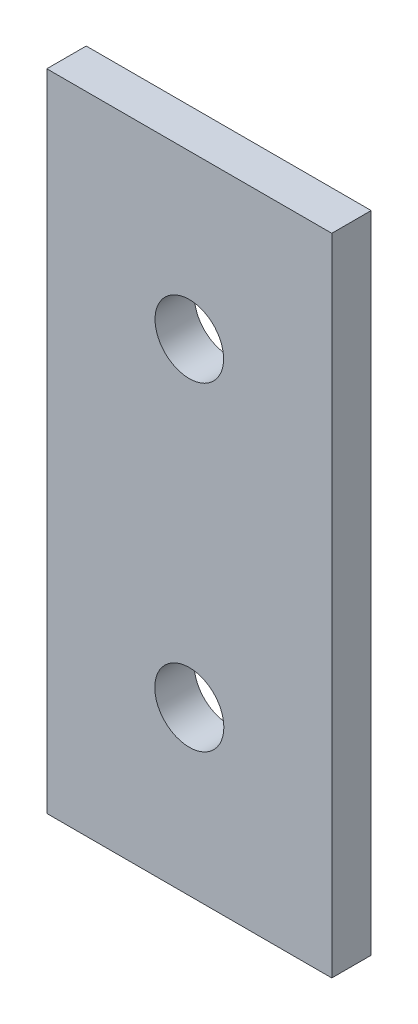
from build123d import *

# Parameters (mm, degrees)
SKETCH1_W           = 33.782
SKETCH1_H           = 76.454
BOSS_EXTRUDE1_DEPTH = 4.67106
SKETCH2_R           = 4.064
SKETCH2_R_2         = 4.094725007
CUT_EXTRUDE1_DEPTH  = 43.052683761


with BuildPart() as part:
    # Sketch1 → Boss-Extrude1 (new body)
    with BuildSketch(Plane.XY):
        Rectangle(SKETCH1_W, SKETCH1_H)
    extrude(amount=BOSS_EXTRUDE1_DEPTH)

    # Sketch2 → Cut-Extrude1 (cut, through all)
    with BuildSketch(Plane.XY.offset(4.67106)):
        with Locations((0, 18.923)):
            Circle(SKETCH2_R)
        with Locations((0, -18.892274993)):
            Circle(SKETCH2_R_2)
    extrude(amount=-CUT_EXTRUDE1_DEPTH, mode=Mode.SUBTRACT)


solid = part.part
